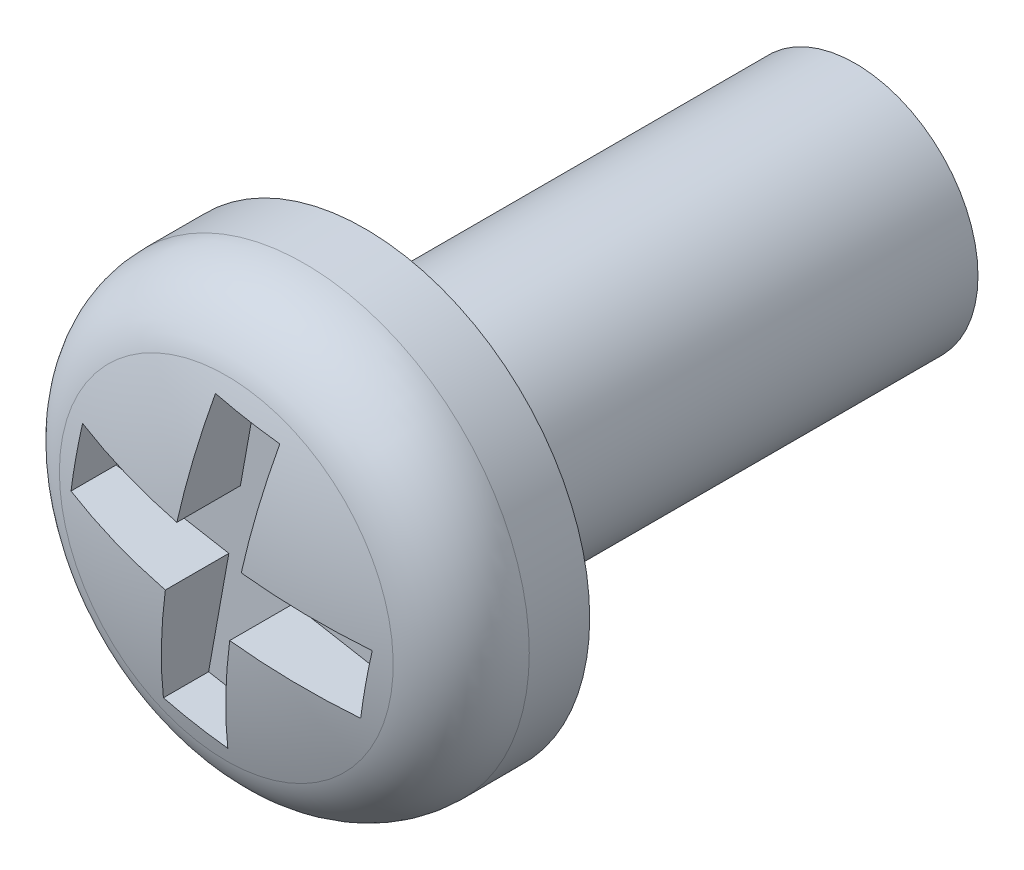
ISO-10303-21;
HEADER;
FILE_DESCRIPTION(('STEP AP214'),'2;1');
FILE_NAME('part.step','',(''),(''),'','','');
FILE_SCHEMA(('AUTOMOTIVE_DESIGN { 1 0 10303 214 1 1 1 1 }'));
ENDSEC;
DATA;
#1=APPLICATION_CONTEXT('core data for automotive mechanical design processes');
#2=APPLICATION_PROTOCOL_DEFINITION('international standard','automotive_design',2000,#1);
#3=PRODUCT_CONTEXT('',#1,'mechanical');
#4=PRODUCT('Part','Part','',(#3));
#5=PRODUCT_RELATED_PRODUCT_CATEGORY('part','',(#4));
#6=PRODUCT_DEFINITION_FORMATION('','',#4);
#7=PRODUCT_DEFINITION_CONTEXT('part definition',#1,'design');
#8=PRODUCT_DEFINITION('design','',#6,#7);
#9=PRODUCT_DEFINITION_SHAPE('','',#8);
#10=(LENGTH_UNIT() NAMED_UNIT(*) SI_UNIT(.MILLI.,.METRE.));
#11=(NAMED_UNIT(*) PLANE_ANGLE_UNIT() SI_UNIT($,.RADIAN.));
#12=(NAMED_UNIT(*) SI_UNIT($,.STERADIAN.) SOLID_ANGLE_UNIT());
#13=UNCERTAINTY_MEASURE_WITH_UNIT(LENGTH_MEASURE(1.E-05),#10,'distance_accuracy_value','');
#14=(GEOMETRIC_REPRESENTATION_CONTEXT(3) GLOBAL_UNCERTAINTY_ASSIGNED_CONTEXT((#13)) GLOBAL_UNIT_ASSIGNED_CONTEXT((#10,
#11,#12)) REPRESENTATION_CONTEXT('',''));
#15=CARTESIAN_POINT('',(0.,0.,0.));
#16=DIRECTION('',(0.,0.,1.));
#17=DIRECTION('',(1.,0.,0.));
#18=AXIS2_PLACEMENT_3D('',#15,#16,#17);
#19=CARTESIAN_POINT('',(-22.2009533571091,31.8118714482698,2.2));
#20=DIRECTION('',(0.,0.,-1.));
#21=DIRECTION('',(-1.,0.,0.));
#22=AXIS2_PLACEMENT_3D('',#19,#20,#21);
#23=PLANE('',#22);
#24=DIRECTION('',(0.984254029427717,-0.176759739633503,0.));
#25=VECTOR('',#24,1.);
#26=CARTESIAN_POINT('',(-20.9644055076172,30.7770045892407,2.2));
#27=LINE('',#26,#25);
#28=CARTESIAN_POINT('',(-22.342361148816,31.0244682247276,2.2));
#29=VERTEX_POINT('',#28);
#30=CARTESIAN_POINT('',(-20.9644055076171,30.7770045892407,2.2));
#31=VERTEX_POINT('',#30);
#32=EDGE_CURVE('E255',#29,#31,#27,.T.);
#33=ORIENTED_EDGE('',*,*,#32,.T.);
#34=DIRECTION('',(-0.176759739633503,-0.984254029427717,0.));
#35=VECTOR('',#34,1.);
#36=CARTESIAN_POINT('',(-21.2118691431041,29.3990489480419,2.2));
#37=LINE('',#36,#35);
#38=CARTESIAN_POINT('',(-21.2118691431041,29.3990489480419,2.2));
#39=VERTEX_POINT('',#38);
#40=EDGE_CURVE('E266',#31,#39,#37,.T.);
#41=ORIENTED_EDGE('',*,*,#40,.T.);
#42=DIRECTION('',(0.984254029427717,-0.176759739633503,0.));
#43=VECTOR('',#42,1.);
#44=CARTESIAN_POINT('',(-20.4244659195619,29.2576411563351,2.2));
#45=LINE('',#44,#43);
#46=CARTESIAN_POINT('',(-20.4244659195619,29.2576411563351,2.2));
#47=VERTEX_POINT('',#46);
#48=EDGE_CURVE('E271',#39,#47,#45,.T.);
#49=ORIENTED_EDGE('',*,*,#48,.T.);
#50=DIRECTION('',(0.176759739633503,0.984254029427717,0.));
#51=VECTOR('',#50,1.);
#52=CARTESIAN_POINT('',(-20.177002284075,30.6355967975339,2.2));
#53=LINE('',#52,#51);
#54=CARTESIAN_POINT('',(-20.177002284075,30.6355967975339,2.2));
#55=VERTEX_POINT('',#54);
#56=EDGE_CURVE('E276',#47,#55,#53,.T.);
#57=ORIENTED_EDGE('',*,*,#56,.T.);
#58=DIRECTION('',(0.984254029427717,-0.176759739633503,0.));
#59=VECTOR('',#58,1.);
#60=CARTESIAN_POINT('',(-18.7990466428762,30.388133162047,2.2));
#61=LINE('',#60,#59);
#62=CARTESIAN_POINT('',(-18.7990466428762,30.388133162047,2.2));
#63=VERTEX_POINT('',#62);
#64=EDGE_CURVE('E281',#55,#63,#61,.T.);
#65=ORIENTED_EDGE('',*,*,#64,.T.);
#66=DIRECTION('',(0.176759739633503,0.984254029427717,0.));
#67=VECTOR('',#66,1.);
#68=CARTESIAN_POINT('',(-18.6576388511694,31.1755363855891,2.2));
#69=LINE('',#68,#67);
#70=CARTESIAN_POINT('',(-18.6576388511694,31.1755363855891,2.2));
#71=VERTEX_POINT('',#70);
#72=EDGE_CURVE('E286',#63,#71,#69,.T.);
#73=ORIENTED_EDGE('',*,*,#72,.T.);
#74=DIRECTION('',(-0.984254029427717,0.176759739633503,0.));
#75=VECTOR('',#74,1.);
#76=CARTESIAN_POINT('',(-20.0355944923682,31.423000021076,2.2));
#77=LINE('',#76,#75);
#78=CARTESIAN_POINT('',(-20.0355944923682,31.423000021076,2.2));
#79=VERTEX_POINT('',#78);
#80=EDGE_CURVE('E291',#71,#79,#77,.T.);
#81=ORIENTED_EDGE('',*,*,#80,.T.);
#82=DIRECTION('',(0.176759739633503,0.984254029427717,0.));
#83=VECTOR('',#82,1.);
#84=CARTESIAN_POINT('',(-19.7881308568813,32.8009556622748,2.2));
#85=LINE('',#84,#83);
#86=CARTESIAN_POINT('',(-19.7881308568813,32.8009556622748,2.2));
#87=VERTEX_POINT('',#86);
#88=EDGE_CURVE('E296',#79,#87,#85,.T.);
#89=ORIENTED_EDGE('',*,*,#88,.T.);
#90=DIRECTION('',(-0.984254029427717,0.176759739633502,0.));
#91=VECTOR('',#90,1.);
#92=CARTESIAN_POINT('',(-20.5755340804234,32.9423634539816,2.2));
#93=LINE('',#92,#91);
#94=CARTESIAN_POINT('',(-20.5755340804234,32.9423634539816,2.2));
#95=VERTEX_POINT('',#94);
#96=EDGE_CURVE('E238',#87,#95,#93,.T.);
#97=ORIENTED_EDGE('',*,*,#96,.T.);
#98=DIRECTION('',(-0.176759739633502,-0.984254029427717,0.));
#99=VECTOR('',#98,1.);
#100=CARTESIAN_POINT('',(-20.8229977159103,31.5644078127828,2.2));
#101=LINE('',#100,#99);
#102=CARTESIAN_POINT('',(-20.8229977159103,31.5644078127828,2.2));
#103=VERTEX_POINT('',#102);
#104=EDGE_CURVE('E240',#95,#103,#101,.T.);
#105=ORIENTED_EDGE('',*,*,#104,.T.);
#106=DIRECTION('',(-0.984254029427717,0.176759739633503,0.));
#107=VECTOR('',#106,1.);
#108=CARTESIAN_POINT('',(-22.2009533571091,31.8118714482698,2.2));
#109=LINE('',#108,#107);
#110=CARTESIAN_POINT('',(-22.2009533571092,31.8118714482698,2.2));
#111=VERTEX_POINT('',#110);
#112=EDGE_CURVE('E241',#103,#111,#109,.T.);
#113=ORIENTED_EDGE('',*,*,#112,.T.);
#114=DIRECTION('',(-0.176759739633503,-0.984254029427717,0.));
#115=VECTOR('',#114,1.);
#116=CARTESIAN_POINT('',(-22.342361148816,31.0244682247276,2.2));
#117=LINE('',#116,#115);
#118=EDGE_CURVE('E209',#111,#29,#117,.T.);
#119=ORIENTED_EDGE('',*,*,#118,.T.);
#120=EDGE_LOOP('',(#33,#41,#49,#57,#65,#73,#81,#89,#97,#105,#113,#119));
#121=FACE_BOUND('',#120,.T.);
#122=ADVANCED_FACE('F17',(#121),#23,.F.);
#123=CARTESIAN_POINT('',(-22.2009533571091,31.8118714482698,2.2));
#124=DIRECTION('',(0.176759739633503,0.984254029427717,0.));
#125=DIRECTION('',(-0.984254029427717,0.176759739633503,0.));
#126=AXIS2_PLACEMENT_3D('',#123,#124,#125);
#127=PLANE('',#126);
#128=ORIENTED_EDGE('',*,*,#112,.F.);
#129=DIRECTION('',(0.,0.,1.));
#130=VECTOR('',#129,1.);
#131=CARTESIAN_POINT('',(-20.8229977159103,31.5644078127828,2.2));
#132=LINE('',#131,#130);
#133=CARTESIAN_POINT('',(-20.8229977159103,31.5644078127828,2.97710541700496));
#134=VERTEX_POINT('',#133);
#135=EDGE_CURVE('E202',#103,#134,#132,.T.);
#136=ORIENTED_EDGE('',*,*,#135,.T.);
#137=CARTESIAN_POINT('',(-22.2009533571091,31.8118714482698,2.75277720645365));
#138=CARTESIAN_POINT('',(-22.1445441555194,31.8017410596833,2.76805420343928));
#139=CARTESIAN_POINT('',(-22.087943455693,31.7915762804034,2.78260124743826));
#140=CARTESIAN_POINT('',(-21.9745055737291,31.7712042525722,2.81020007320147));
#141=CARTESIAN_POINT('',(-21.9176690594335,31.7609971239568,2.82325468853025));
#142=CARTESIAN_POINT('',(-21.8037612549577,31.7405407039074,2.84787651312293));
#143=CARTESIAN_POINT('',(-21.7466903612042,31.7302914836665,2.85944561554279));
#144=CARTESIAN_POINT('',(-21.6323149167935,31.7097510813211,2.88110167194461));
#145=CARTESIAN_POINT('',(-21.5750105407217,31.6994599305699,2.8911895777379));
#146=CARTESIAN_POINT('',(-21.4601684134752,31.6788357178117,2.90988562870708));
#147=CARTESIAN_POINT('',(-21.4026306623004,31.6685026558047,2.91849377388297));
#148=CARTESIAN_POINT('',(-21.2873215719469,31.6477945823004,2.93422986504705));
#149=CARTESIAN_POINT('',(-21.2295501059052,31.6374195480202,2.94135685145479));
#150=CARTESIAN_POINT('',(-21.1137731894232,31.616627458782,2.95412720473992));
#151=CARTESIAN_POINT('',(-21.0557675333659,31.6062103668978,2.95976864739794));
#152=CARTESIAN_POINT('',(-20.9395215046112,31.5853340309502,2.96956186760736));
#153=CARTESIAN_POINT('',(-20.8812808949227,31.5748747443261,2.97371074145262));
#154=CARTESIAN_POINT('',(-20.8229977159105,31.5644078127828,2.97710541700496));
#155=B_SPLINE_CURVE_WITH_KNOTS('',3,(#137,#138,#139,#140,#141,#142,#143,#144,#145,#146,#147,
#148,#149,#150,#151,#152,#153,#154),.UNSPECIFIED.,.F.,.F.,(4,2,2,2,2,2,2,2,4),(0.,
0.177933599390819,0.355523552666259,0.532884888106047,0.710131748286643,0.887378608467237,
1.06473994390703,1.24232989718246,1.42026349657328),.UNSPECIFIED.);
#156=CARTESIAN_POINT('',(-22.2009533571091,31.8118714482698,2.75277720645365));
#157=VERTEX_POINT('',#156);
#158=EDGE_CURVE('E20',#157,#134,#155,.T.);
#159=ORIENTED_EDGE('',*,*,#158,.F.);
#160=DIRECTION('',(0.,0.,1.));
#161=VECTOR('',#160,1.);
#162=CARTESIAN_POINT('',(-22.2009533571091,31.8118714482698,2.2));
#163=LINE('',#162,#161);
#164=EDGE_CURVE('E88',#157,#111,#163,.F.);
#165=ORIENTED_EDGE('',*,*,#164,.T.);
#166=EDGE_LOOP('',(#128,#136,#159,#165));
#167=FACE_BOUND('',#166,.T.);
#168=ADVANCED_FACE('F199',(#167),#127,.F.);
#169=CARTESIAN_POINT('',(-20.8229977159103,31.5644078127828,2.2));
#170=DIRECTION('',(-0.984254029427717,0.176759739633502,0.));
#171=DIRECTION('',(-0.176759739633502,-0.984254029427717,0.));
#172=AXIS2_PLACEMENT_3D('',#169,#170,#171);
#173=PLANE('',#172);
#174=ORIENTED_EDGE('',*,*,#104,.F.);
#175=DIRECTION('',(0.,0.,1.));
#176=VECTOR('',#175,1.);
#177=CARTESIAN_POINT('',(-20.5755340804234,32.9423634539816,2.2));
#178=LINE('',#177,#176);
#179=CARTESIAN_POINT('',(-20.5755340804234,32.9423634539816,2.75277720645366));
#180=VERTEX_POINT('',#179);
#181=EDGE_CURVE('E247',#95,#180,#178,.T.);
#182=ORIENTED_EDGE('',*,*,#181,.T.);
#183=CARTESIAN_POINT('',(-20.8937016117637,31.1707062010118,-4.));
#184=DIRECTION('',(0.984254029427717,-0.176759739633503,0.));
#185=DIRECTION('',(0.176759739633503,0.984254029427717,0.));
#186=AXIS2_PLACEMENT_3D('',#183,#184,#185);
#187=CIRCLE('',#186,6.98856208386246);
#188=EDGE_CURVE('E194',#134,#180,#187,.F.);
#189=ORIENTED_EDGE('',*,*,#188,.F.);
#190=ORIENTED_EDGE('',*,*,#135,.F.);
#191=EDGE_LOOP('',(#174,#182,#189,#190));
#192=FACE_BOUND('',#191,.T.);
#193=ADVANCED_FACE('F187',(#192),#173,.F.);
#194=CARTESIAN_POINT('',(-20.5755340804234,32.9423634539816,2.2));
#195=DIRECTION('',(0.176759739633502,0.984254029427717,0.));
#196=DIRECTION('',(-0.984254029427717,0.176759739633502,0.));
#197=AXIS2_PLACEMENT_3D('',#194,#195,#196);
#198=PLANE('',#197);
#199=ORIENTED_EDGE('',*,*,#96,.F.);
#200=DIRECTION('',(0.,0.,1.));
#201=VECTOR('',#200,1.);
#202=CARTESIAN_POINT('',(-19.7881308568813,32.8009556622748,2.2));
#203=LINE('',#202,#201);
#204=CARTESIAN_POINT('',(-19.7881308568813,32.8009556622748,2.75277720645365));
#205=VERTEX_POINT('',#204);
#206=EDGE_CURVE('E293',#87,#205,#203,.T.);
#207=ORIENTED_EDGE('',*,*,#206,.T.);
#208=CARTESIAN_POINT('',(-20.5755340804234,32.9423634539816,2.75277720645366));
#209=CARTESIAN_POINT('',(-20.4443002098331,32.9187954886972,2.76066827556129));
#210=CARTESIAN_POINT('',(-20.3130663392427,32.8952275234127,2.76461381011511));
#211=CARTESIAN_POINT('',(-20.050598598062,32.8480915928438,2.76461381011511));
#212=CARTESIAN_POINT('',(-19.9193647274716,32.8245236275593,2.76066827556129));
#213=CARTESIAN_POINT('',(-19.7881308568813,32.8009556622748,2.75277720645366));
#214=B_SPLINE_CURVE_WITH_KNOTS('',3,(#208,#209,#210,#211,#212,#213),.UNSPECIFIED.,.F.,.F.,(4,2,
4),(0.,0.400175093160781,0.800350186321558),.UNSPECIFIED.);
#215=EDGE_CURVE('E189',#180,#205,#214,.T.);
#216=ORIENTED_EDGE('',*,*,#215,.F.);
#217=ORIENTED_EDGE('',*,*,#181,.F.);
#218=EDGE_LOOP('',(#199,#207,#216,#217));
#219=FACE_BOUND('',#218,.T.);
#220=ADVANCED_FACE('F182',(#219),#198,.F.);
#221=CARTESIAN_POINT('',(-19.7881308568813,32.8009556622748,2.2));
#222=DIRECTION('',(0.984254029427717,-0.176759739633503,0.));
#223=DIRECTION('',(0.176759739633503,0.984254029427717,0.));
#224=AXIS2_PLACEMENT_3D('',#221,#222,#223);
#225=PLANE('',#224);
#226=ORIENTED_EDGE('',*,*,#88,.F.);
#227=DIRECTION('',(0.,0.,1.));
#228=VECTOR('',#227,1.);
#229=CARTESIAN_POINT('',(-20.0355944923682,31.423000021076,2.2));
#230=LINE('',#229,#228);
#231=CARTESIAN_POINT('',(-20.0355944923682,31.423000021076,2.97710541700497));
#232=VERTEX_POINT('',#231);
#233=EDGE_CURVE('E288',#79,#232,#230,.T.);
#234=ORIENTED_EDGE('',*,*,#233,.T.);
#235=CARTESIAN_POINT('',(-20.1062983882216,31.029298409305,-4.));
#236=DIRECTION('',(0.984254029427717,-0.176759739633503,0.));
#237=DIRECTION('',(0.176759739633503,0.984254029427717,0.));
#238=AXIS2_PLACEMENT_3D('',#235,#236,#237);
#239=CIRCLE('',#238,6.98856208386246);
#240=EDGE_CURVE('E172',#205,#232,#239,.T.);
#241=ORIENTED_EDGE('',*,*,#240,.F.);
#242=ORIENTED_EDGE('',*,*,#206,.F.);
#243=EDGE_LOOP('',(#226,#234,#241,#242));
#244=FACE_BOUND('',#243,.T.);
#245=ADVANCED_FACE('F178',(#244),#225,.F.);
#246=CARTESIAN_POINT('',(-20.0355944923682,31.423000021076,2.2));
#247=DIRECTION('',(0.176759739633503,0.984254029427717,0.));
#248=DIRECTION('',(-0.984254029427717,0.176759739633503,0.));
#249=AXIS2_PLACEMENT_3D('',#246,#247,#248);
#250=PLANE('',#249);
#251=ORIENTED_EDGE('',*,*,#80,.F.);
#252=DIRECTION('',(0.,0.,1.));
#253=VECTOR('',#252,1.);
#254=CARTESIAN_POINT('',(-18.6576388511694,31.1755363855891,2.2));
#255=LINE('',#254,#253);
#256=CARTESIAN_POINT('',(-18.6576388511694,31.1755363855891,2.75277720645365));
#257=VERTEX_POINT('',#256);
#258=EDGE_CURVE('E283',#71,#257,#255,.T.);
#259=ORIENTED_EDGE('',*,*,#258,.T.);
#260=CARTESIAN_POINT('',(-20.0355944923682,31.423000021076,2.97710541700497));
#261=CARTESIAN_POINT('',(-19.977311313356,31.4125330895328,2.97371074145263));
#262=CARTESIAN_POINT('',(-19.9190707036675,31.4020738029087,2.96956186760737));
#263=CARTESIAN_POINT('',(-19.8028246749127,31.3811974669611,2.95976864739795));
#264=CARTESIAN_POINT('',(-19.7448190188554,31.3707803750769,2.95412720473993));
#265=CARTESIAN_POINT('',(-19.6290421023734,31.3499882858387,2.9413568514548));
#266=CARTESIAN_POINT('',(-19.5712706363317,31.3396132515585,2.93422986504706));
#267=CARTESIAN_POINT('',(-19.4559615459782,31.3189051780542,2.91849377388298));
#268=CARTESIAN_POINT('',(-19.3984237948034,31.3085721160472,2.90988562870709));
#269=CARTESIAN_POINT('',(-19.2835816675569,31.2879479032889,2.89118957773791));
#270=CARTESIAN_POINT('',(-19.2262772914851,31.2776567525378,2.88110167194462));
#271=CARTESIAN_POINT('',(-19.1119018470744,31.2571163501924,2.8594456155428));
#272=CARTESIAN_POINT('',(-19.0548309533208,31.2468671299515,2.84787651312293));
#273=CARTESIAN_POINT('',(-18.940923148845,31.2264107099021,2.82325468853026));
#274=CARTESIAN_POINT('',(-18.8840866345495,31.2162035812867,2.81020007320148));
#275=CARTESIAN_POINT('',(-18.7706487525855,31.1958315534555,2.78260124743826));
#276=CARTESIAN_POINT('',(-18.7140480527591,31.1856667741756,2.76805420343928));
#277=CARTESIAN_POINT('',(-18.6576388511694,31.1755363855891,2.75277720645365));
#278=B_SPLINE_CURVE_WITH_KNOTS('',3,(#260,#261,#262,#263,#264,#265,#266,#267,#268,#269,#270,
#271,#272,#273,#274,#275,#276,#277),.UNSPECIFIED.,.F.,.F.,(4,2,2,2,2,2,2,2,4),(0.,
0.177933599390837,0.355523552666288,0.532884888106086,0.710131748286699,0.887378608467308,
1.06473994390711,1.24232989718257,1.4202634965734),.UNSPECIFIED.);
#279=EDGE_CURVE('E165',#232,#257,#278,.T.);
#280=ORIENTED_EDGE('',*,*,#279,.F.);
#281=ORIENTED_EDGE('',*,*,#233,.F.);
#282=EDGE_LOOP('',(#251,#259,#280,#281));
#283=FACE_BOUND('',#282,.T.);
#284=ADVANCED_FACE('F174',(#283),#250,.F.);
#285=CARTESIAN_POINT('',(-18.6576388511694,31.1755363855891,2.2));
#286=DIRECTION('',(0.984254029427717,-0.176759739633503,0.));
#287=DIRECTION('',(0.176759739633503,0.984254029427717,0.));
#288=AXIS2_PLACEMENT_3D('',#285,#286,#287);
#289=PLANE('',#288);
#290=ORIENTED_EDGE('',*,*,#72,.F.);
#291=DIRECTION('',(0.,0.,1.));
#292=VECTOR('',#291,1.);
#293=CARTESIAN_POINT('',(-18.7990466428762,30.388133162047,2.2));
#294=LINE('',#293,#292);
#295=CARTESIAN_POINT('',(-18.7990466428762,30.388133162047,2.75277720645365));
#296=VERTEX_POINT('',#295);
#297=EDGE_CURVE('E278',#63,#296,#294,.T.);
#298=ORIENTED_EDGE('',*,*,#297,.T.);
#299=CARTESIAN_POINT('',(-18.7283427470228,30.7818347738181,2.7646138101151));
#300=CARTESIAN_POINT('',(-18.7637256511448,30.5848115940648,2.7646138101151));
#301=CARTESIAN_POINT('',(-18.7990466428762,30.388133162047,2.75277720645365));
#302=B_SPLINE_CURVE_WITH_KNOTS('',2,(#299,#300,#301),.UNSPECIFIED.,.F.,.F.,(3,3),(0.,1.),.UNSPECIFIED.);
#303=CARTESIAN_POINT('',(-18.7283427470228,30.7818347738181,2.7646138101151));
#304=VERTEX_POINT('',#303);
#305=EDGE_CURVE('E164',#304,#296,#302,.T.);
#306=ORIENTED_EDGE('',*,*,#305,.F.);
#307=CARTESIAN_POINT('',(-18.6576388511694,31.1755363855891,2.75277720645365));
#308=CARTESIAN_POINT('',(-18.6929598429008,30.9788579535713,2.7646138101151));
#309=CARTESIAN_POINT('',(-18.7283427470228,30.7818347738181,2.7646138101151));
#310=B_SPLINE_CURVE_WITH_KNOTS('',2,(#307,#308,#309),.UNSPECIFIED.,.F.,.F.,(3,3),(0.,1.),.UNSPECIFIED.);
#311=EDGE_CURVE('E171',#257,#304,#310,.T.);
#312=ORIENTED_EDGE('',*,*,#311,.F.);
#313=ORIENTED_EDGE('',*,*,#258,.F.);
#314=EDGE_LOOP('',(#290,#298,#306,#312,#313));
#315=FACE_BOUND('',#314,.T.);
#316=ADVANCED_FACE('F154',(#315),#289,.F.);
#317=CARTESIAN_POINT('',(-18.7990466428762,30.388133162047,2.2));
#318=DIRECTION('',(-0.176759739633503,-0.984254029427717,0.));
#319=DIRECTION('',(0.984254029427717,-0.176759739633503,0.));
#320=AXIS2_PLACEMENT_3D('',#317,#318,#319);
#321=PLANE('',#320);
#322=ORIENTED_EDGE('',*,*,#64,.F.);
#323=DIRECTION('',(0.,0.,1.));
#324=VECTOR('',#323,1.);
#325=CARTESIAN_POINT('',(-20.177002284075,30.6355967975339,2.2));
#326=LINE('',#325,#324);
#327=CARTESIAN_POINT('',(-20.177002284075,30.6355967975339,2.97710541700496));
#328=VERTEX_POINT('',#327);
#329=EDGE_CURVE('E273',#55,#328,#326,.T.);
#330=ORIENTED_EDGE('',*,*,#329,.T.);
#331=CARTESIAN_POINT('',(-18.7990466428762,30.388133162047,2.75277720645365));
#332=CARTESIAN_POINT('',(-18.8554558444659,30.3982635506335,2.76805420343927));
#333=CARTESIAN_POINT('',(-18.9120565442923,30.4084283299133,2.78260124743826));
#334=CARTESIAN_POINT('',(-19.0254944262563,30.4288003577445,2.81020007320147));
#335=CARTESIAN_POINT('',(-19.0823309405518,30.4390074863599,2.82325468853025));
#336=CARTESIAN_POINT('',(-19.1962387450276,30.4594639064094,2.84787651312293));
#337=CARTESIAN_POINT('',(-19.2533096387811,30.4697131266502,2.85944561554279));
#338=CARTESIAN_POINT('',(-19.3676850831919,30.4902535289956,2.88110167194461));
#339=CARTESIAN_POINT('',(-19.4249894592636,30.5005446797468,2.8911895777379));
#340=CARTESIAN_POINT('',(-19.5398315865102,30.521168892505,2.90988562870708));
#341=CARTESIAN_POINT('',(-19.5973693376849,30.531501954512,2.91849377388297));
#342=CARTESIAN_POINT('',(-19.7126784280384,30.5522100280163,2.93422986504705));
#343=CARTESIAN_POINT('',(-19.7704498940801,30.5625850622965,2.94135685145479));
#344=CARTESIAN_POINT('',(-19.8862268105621,30.5833771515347,2.95412720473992));
#345=CARTESIAN_POINT('',(-19.9442324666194,30.5937942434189,2.95976864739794));
#346=CARTESIAN_POINT('',(-20.0604784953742,30.6146705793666,2.96956186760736));
#347=CARTESIAN_POINT('',(-20.1187191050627,30.6251298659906,2.97371074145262));
#348=CARTESIAN_POINT('',(-20.1770022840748,30.6355967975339,2.97710541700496));
#349=B_SPLINE_CURVE_WITH_KNOTS('',3,(#331,#332,#333,#334,#335,#336,#337,#338,#339,#340,#341,
#342,#343,#344,#345,#346,#347,#348),.UNSPECIFIED.,.F.,.F.,(4,2,2,2,2,2,2,2,4),(0.,
0.177933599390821,0.355523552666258,0.532884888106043,0.710131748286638,0.887378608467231,
1.06473994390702,1.24232989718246,1.42026349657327),.UNSPECIFIED.);
#350=EDGE_CURVE('E158',#296,#328,#349,.T.);
#351=ORIENTED_EDGE('',*,*,#350,.F.);
#352=ORIENTED_EDGE('',*,*,#297,.F.);
#353=EDGE_LOOP('',(#322,#330,#351,#352));
#354=FACE_BOUND('',#353,.T.);
#355=ADVANCED_FACE('F149',(#354),#321,.F.);
#356=CARTESIAN_POINT('',(-20.177002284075,30.6355967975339,2.2));
#357=DIRECTION('',(0.984254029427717,-0.176759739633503,0.));
#358=DIRECTION('',(0.176759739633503,0.984254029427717,0.));
#359=AXIS2_PLACEMENT_3D('',#356,#357,#358);
#360=PLANE('',#359);
#361=ORIENTED_EDGE('',*,*,#56,.F.);
#362=DIRECTION('',(0.,0.,1.));
#363=VECTOR('',#362,1.);
#364=CARTESIAN_POINT('',(-20.4244659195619,29.2576411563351,2.2));
#365=LINE('',#364,#363);
#366=CARTESIAN_POINT('',(-20.4244659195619,29.2576411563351,2.75277720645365));
#367=VERTEX_POINT('',#366);
#368=EDGE_CURVE('E268',#47,#367,#365,.T.);
#369=ORIENTED_EDGE('',*,*,#368,.T.);
#370=CARTESIAN_POINT('',(-20.1062983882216,31.029298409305,-4.));
#371=DIRECTION('',(0.984254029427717,-0.176759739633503,0.));
#372=DIRECTION('',(0.176759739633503,0.984254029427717,0.));
#373=AXIS2_PLACEMENT_3D('',#370,#371,#372);
#374=CIRCLE('',#373,6.98856208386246);
#375=EDGE_CURVE('E139',#328,#367,#374,.T.);
#376=ORIENTED_EDGE('',*,*,#375,.F.);
#377=ORIENTED_EDGE('',*,*,#329,.F.);
#378=EDGE_LOOP('',(#361,#369,#376,#377));
#379=FACE_BOUND('',#378,.T.);
#380=ADVANCED_FACE('F145',(#379),#360,.F.);
#381=CARTESIAN_POINT('',(-20.4244659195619,29.2576411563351,2.2));
#382=DIRECTION('',(-0.176759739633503,-0.984254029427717,0.));
#383=DIRECTION('',(0.984254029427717,-0.176759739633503,0.));
#384=AXIS2_PLACEMENT_3D('',#381,#382,#383);
#385=PLANE('',#384);
#386=ORIENTED_EDGE('',*,*,#48,.F.);
#387=DIRECTION('',(0.,0.,1.));
#388=VECTOR('',#387,1.);
#389=CARTESIAN_POINT('',(-21.2118691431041,29.3990489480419,2.2));
#390=LINE('',#389,#388);
#391=CARTESIAN_POINT('',(-21.211869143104,29.3990489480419,2.75277720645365));
#392=VERTEX_POINT('',#391);
#393=EDGE_CURVE('E258',#39,#392,#390,.T.);
#394=ORIENTED_EDGE('',*,*,#393,.T.);
#395=CARTESIAN_POINT('',(-20.4244659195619,29.2576411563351,2.75277720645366));
#396=CARTESIAN_POINT('',(-20.5556997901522,29.2812091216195,2.76066827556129));
#397=CARTESIAN_POINT('',(-20.6869336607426,29.304777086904,2.76461381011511));
#398=CARTESIAN_POINT('',(-20.9494014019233,29.3519130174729,2.76461381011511));
#399=CARTESIAN_POINT('',(-21.0806352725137,29.3754809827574,2.76066827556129));
#400=CARTESIAN_POINT('',(-21.2118691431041,29.3990489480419,2.75277720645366));
#401=B_SPLINE_CURVE_WITH_KNOTS('',3,(#395,#396,#397,#398,#399,#400),.UNSPECIFIED.,.F.,.F.,(4,2,
4),(0.,0.400175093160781,0.800350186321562),.UNSPECIFIED.);
#402=EDGE_CURVE('E133',#367,#392,#401,.T.);
#403=ORIENTED_EDGE('',*,*,#402,.F.);
#404=ORIENTED_EDGE('',*,*,#368,.F.);
#405=EDGE_LOOP('',(#386,#394,#403,#404));
#406=FACE_BOUND('',#405,.T.);
#407=ADVANCED_FACE('F141',(#406),#385,.F.);
#408=CARTESIAN_POINT('',(-21.2118691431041,29.3990489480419,2.2));
#409=DIRECTION('',(-0.984254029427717,0.176759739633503,0.));
#410=DIRECTION('',(-0.176759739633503,-0.984254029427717,0.));
#411=AXIS2_PLACEMENT_3D('',#408,#409,#410);
#412=PLANE('',#411);
#413=ORIENTED_EDGE('',*,*,#40,.F.);
#414=DIRECTION('',(0.,0.,1.));
#415=VECTOR('',#414,1.);
#416=CARTESIAN_POINT('',(-20.9644055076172,30.7770045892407,2.2));
#417=LINE('',#416,#415);
#418=CARTESIAN_POINT('',(-20.9644055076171,30.7770045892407,2.97710541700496));
#419=VERTEX_POINT('',#418);
#420=EDGE_CURVE('E257',#31,#419,#417,.T.);
#421=ORIENTED_EDGE('',*,*,#420,.T.);
#422=CARTESIAN_POINT('',(-20.8937016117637,31.1707062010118,-4.));
#423=DIRECTION('',(0.984254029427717,-0.176759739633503,0.));
#424=DIRECTION('',(0.176759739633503,0.984254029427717,0.));
#425=AXIS2_PLACEMENT_3D('',#422,#423,#424);
#426=CIRCLE('',#425,6.98856208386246);
#427=EDGE_CURVE('E101',#392,#419,#426,.F.);
#428=ORIENTED_EDGE('',*,*,#427,.F.);
#429=ORIENTED_EDGE('',*,*,#393,.F.);
#430=EDGE_LOOP('',(#413,#421,#428,#429));
#431=FACE_BOUND('',#430,.T.);
#432=ADVANCED_FACE('F125',(#431),#412,.F.);
#433=CARTESIAN_POINT('',(-20.9644055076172,30.7770045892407,2.2));
#434=DIRECTION('',(-0.176759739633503,-0.984254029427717,0.));
#435=DIRECTION('',(0.984254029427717,-0.176759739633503,0.));
#436=AXIS2_PLACEMENT_3D('',#433,#434,#435);
#437=PLANE('',#436);
#438=ORIENTED_EDGE('',*,*,#32,.F.);
#439=DIRECTION('',(0.,0.,1.));
#440=VECTOR('',#439,1.);
#441=CARTESIAN_POINT('',(-22.342361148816,31.0244682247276,2.2));
#442=LINE('',#441,#440);
#443=CARTESIAN_POINT('',(-22.342361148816,31.0244682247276,2.75277720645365));
#444=VERTEX_POINT('',#443);
#445=EDGE_CURVE('E39',#29,#444,#442,.T.);
#446=ORIENTED_EDGE('',*,*,#445,.T.);
#447=CARTESIAN_POINT('',(-20.9644055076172,30.7770045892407,2.97710541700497));
#448=CARTESIAN_POINT('',(-21.0226886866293,30.7874715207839,2.97371074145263));
#449=CARTESIAN_POINT('',(-21.0809292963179,30.797930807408,2.96956186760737));
#450=CARTESIAN_POINT('',(-21.1971753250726,30.8188071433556,2.95976864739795));
#451=CARTESIAN_POINT('',(-21.2551809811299,30.8292242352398,2.95412720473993));
#452=CARTESIAN_POINT('',(-21.370957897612,30.850016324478,2.9413568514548));
#453=CARTESIAN_POINT('',(-21.4287293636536,30.8603913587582,2.93422986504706));
#454=CARTESIAN_POINT('',(-21.5440384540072,30.8810994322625,2.91849377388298));
#455=CARTESIAN_POINT('',(-21.6015762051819,30.8914324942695,2.90988562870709));
#456=CARTESIAN_POINT('',(-21.7164183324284,30.9120567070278,2.89118957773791));
#457=CARTESIAN_POINT('',(-21.7737227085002,30.922347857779,2.88110167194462));
#458=CARTESIAN_POINT('',(-21.888098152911,30.9428882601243,2.8594456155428));
#459=CARTESIAN_POINT('',(-21.9451690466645,30.9531374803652,2.84787651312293));
#460=CARTESIAN_POINT('',(-22.0590768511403,30.9735939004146,2.82325468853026));
#461=CARTESIAN_POINT('',(-22.1159133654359,30.98380102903,2.81020007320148));
#462=CARTESIAN_POINT('',(-22.2293512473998,31.0041730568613,2.78260124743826));
#463=CARTESIAN_POINT('',(-22.2859519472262,31.0143378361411,2.76805420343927));
#464=CARTESIAN_POINT('',(-22.342361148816,31.0244682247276,2.75277720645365));
#465=B_SPLINE_CURVE_WITH_KNOTS('',3,(#447,#448,#449,#450,#451,#452,#453,#454,#455,#456,#457,
#458,#459,#460,#461,#462,#463,#464),.UNSPECIFIED.,.F.,.F.,(4,2,2,2,2,2,2,2,4),(0.,
0.177933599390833,0.355523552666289,0.532884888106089,0.710131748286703,0.887378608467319,
1.06473994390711,1.24232989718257,1.4202634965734),.UNSPECIFIED.);
#466=EDGE_CURVE('E95',#419,#444,#465,.T.);
#467=ORIENTED_EDGE('',*,*,#466,.F.);
#468=ORIENTED_EDGE('',*,*,#420,.F.);
#469=EDGE_LOOP('',(#438,#446,#467,#468));
#470=FACE_BOUND('',#469,.T.);
#471=ADVANCED_FACE('F118',(#470),#437,.F.);
#472=CARTESIAN_POINT('',(-22.342361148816,31.0244682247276,2.2));
#473=DIRECTION('',(-0.984254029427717,0.176759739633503,0.));
#474=DIRECTION('',(-0.176759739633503,-0.984254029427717,0.));
#475=AXIS2_PLACEMENT_3D('',#472,#473,#474);
#476=PLANE('',#475);
#477=ORIENTED_EDGE('',*,*,#118,.F.);
#478=ORIENTED_EDGE('',*,*,#164,.F.);
#479=CARTESIAN_POINT('',(-22.2716572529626,31.4181698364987,2.7646138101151));
#480=CARTESIAN_POINT('',(-22.2362743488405,31.6151930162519,2.7646138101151));
#481=CARTESIAN_POINT('',(-22.2009533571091,31.8118714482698,2.75277720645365));
#482=B_SPLINE_CURVE_WITH_KNOTS('',2,(#479,#480,#481),.UNSPECIFIED.,.F.,.F.,(3,3),(0.,1.),.UNSPECIFIED.);
#483=CARTESIAN_POINT('',(-22.2716572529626,31.4181698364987,2.7646138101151));
#484=VERTEX_POINT('',#483);
#485=EDGE_CURVE('E81',#484,#157,#482,.T.);
#486=ORIENTED_EDGE('',*,*,#485,.F.);
#487=CARTESIAN_POINT('',(-22.342361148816,31.0244682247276,2.75277720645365));
#488=CARTESIAN_POINT('',(-22.3070401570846,31.2211466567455,2.7646138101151));
#489=CARTESIAN_POINT('',(-22.2716572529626,31.4181698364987,2.7646138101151));
#490=B_SPLINE_CURVE_WITH_KNOTS('',2,(#487,#488,#489),.UNSPECIFIED.,.F.,.F.,(3,3),(0.,1.),.UNSPECIFIED.);
#491=EDGE_CURVE('E85',#444,#484,#490,.T.);
#492=ORIENTED_EDGE('',*,*,#491,.F.);
#493=ORIENTED_EDGE('',*,*,#445,.F.);
#494=EDGE_LOOP('',(#477,#478,#486,#492,#493));
#495=FACE_BOUND('',#494,.T.);
#496=ADVANCED_FACE('F84',(#495),#476,.F.);
#497=CARTESIAN_POINT('',(-20.4999999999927,31.1000023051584,-4.));
#498=DIRECTION('',(0.984254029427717,-0.176759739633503,0.));
#499=DIRECTION('',(0.,0.,-1.));
#500=AXIS2_PLACEMENT_3D('',#497,#498,#499);
#501=SPHERICAL_SURFACE('',#500,7.);
#502=CARTESIAN_POINT('',(-20.4999999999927,31.1000023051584,2.69564016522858));
#503=DIRECTION('',(0.,0.,1.));
#504=DIRECTION('',(-0.176759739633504,-0.984254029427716,0.));
#505=AXIS2_PLACEMENT_3D('',#502,#503,#504);
#506=CIRCLE('',#505,2.04166666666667);
#507=CARTESIAN_POINT('',(-20.8608844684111,29.0904836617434,2.69564016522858));
#508=VERTEX_POINT('',#507);
#509=EDGE_CURVE('E96',#508,#508,#506,.F.);
#510=ORIENTED_EDGE('',*,*,#509,.F.);
#511=EDGE_LOOP('',(#510));
#512=FACE_BOUND('',#511,.T.);
#513=ORIENTED_EDGE('',*,*,#466,.T.);
#514=ORIENTED_EDGE('',*,*,#491,.T.);
#515=ORIENTED_EDGE('',*,*,#485,.T.);
#516=ORIENTED_EDGE('',*,*,#158,.T.);
#517=ORIENTED_EDGE('',*,*,#188,.T.);
#518=ORIENTED_EDGE('',*,*,#215,.T.);
#519=ORIENTED_EDGE('',*,*,#240,.T.);
#520=ORIENTED_EDGE('',*,*,#279,.T.);
#521=ORIENTED_EDGE('',*,*,#311,.T.);
#522=ORIENTED_EDGE('',*,*,#305,.T.);
#523=ORIENTED_EDGE('',*,*,#350,.T.);
#524=ORIENTED_EDGE('',*,*,#375,.T.);
#525=ORIENTED_EDGE('',*,*,#402,.T.);
#526=ORIENTED_EDGE('',*,*,#427,.T.);
#527=EDGE_LOOP('',(#513,#514,#515,#516,#517,#518,#519,#520,#521,#522,#523,#524,#525,#526));
#528=FACE_BOUND('',#527,.T.);
#529=ADVANCED_FACE('F93',(#512,#528),#501,.T.);
#530=CARTESIAN_POINT('',(-20.4999999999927,31.1000023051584,1.7391201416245));
#531=DIRECTION('',(0.,0.,1.));
#532=DIRECTION('',(-0.176759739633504,-0.984254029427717,0.));
#533=AXIS2_PLACEMENT_3D('',#530,#531,#532);
#534=TOROIDAL_SURFACE('',#533,1.75,1.);
#535=ORIENTED_EDGE('',*,*,#509,.T.);
#536=EDGE_LOOP('',(#535));
#537=FACE_BOUND('',#536,.T.);
#538=CARTESIAN_POINT('',(-20.4999999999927,31.1000023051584,1.7391201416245));
#539=DIRECTION('',(0.,0.,1.));
#540=DIRECTION('',(1.,0.,0.));
#541=AXIS2_PLACEMENT_3D('',#538,#539,#540);
#542=CIRCLE('',#541,2.75);
#543=CARTESIAN_POINT('',(-17.7499999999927,31.1000023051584,1.7391201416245));
#544=VERTEX_POINT('',#543);
#545=EDGE_CURVE('E99',#544,#544,#542,.F.);
#546=ORIENTED_EDGE('',*,*,#545,.F.);
#547=EDGE_LOOP('',(#546));
#548=FACE_BOUND('',#547,.T.);
#549=ADVANCED_FACE('F314',(#537,#548),#534,.T.);
#550=CARTESIAN_POINT('',(-20.4999999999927,31.1000023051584,3.));
#551=DIRECTION('',(0.,0.,1.));
#552=DIRECTION('',(1.,0.,0.));
#553=AXIS2_PLACEMENT_3D('',#550,#551,#552);
#554=CYLINDRICAL_SURFACE('',#553,2.75);
#555=ORIENTED_EDGE('',*,*,#545,.T.);
#556=EDGE_LOOP('',(#555));
#557=FACE_BOUND('',#556,.T.);
#558=CARTESIAN_POINT('',(-20.4999999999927,31.1000023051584,1.));
#559=DIRECTION('',(0.,0.,1.));
#560=DIRECTION('',(1.,0.,0.));
#561=AXIS2_PLACEMENT_3D('',#558,#559,#560);
#562=CIRCLE('',#561,2.75);
#563=CARTESIAN_POINT('',(-17.7499999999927,31.1000023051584,1.));
#564=VERTEX_POINT('',#563);
#565=EDGE_CURVE('E305',#564,#564,#562,.T.);
#566=ORIENTED_EDGE('',*,*,#565,.T.);
#567=EDGE_LOOP('',(#566));
#568=FACE_BOUND('',#567,.T.);
#569=ADVANCED_FACE('F317',(#557,#568),#554,.T.);
#570=CARTESIAN_POINT('',(-19.0236189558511,30.8348626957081,-5.));
#571=DIRECTION('',(0.,0.,1.));
#572=DIRECTION('',(1.,0.,0.));
#573=AXIS2_PLACEMENT_3D('',#570,#571,#572);
#574=PLANE('',#573);
#575=CARTESIAN_POINT('',(-20.4999999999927,31.1000023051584,-5.));
#576=DIRECTION('',(0.,0.,1.));
#577=DIRECTION('',(1.,0.,0.));
#578=AXIS2_PLACEMENT_3D('',#575,#576,#577);
#579=CIRCLE('',#578,1.5);
#580=CARTESIAN_POINT('',(-18.9999999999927,31.1000023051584,-5.));
#581=VERTEX_POINT('',#580);
#582=EDGE_CURVE('E30',#581,#581,#579,.T.);
#583=ORIENTED_EDGE('',*,*,#582,.F.);
#584=EDGE_LOOP('',(#583));
#585=FACE_BOUND('',#584,.T.);
#586=ADVANCED_FACE('F321',(#585),#574,.F.);
#587=CARTESIAN_POINT('',(-19.0236189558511,30.8348626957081,1.));
#588=DIRECTION('',(0.,0.,1.));
#589=DIRECTION('',(1.,0.,0.));
#590=AXIS2_PLACEMENT_3D('',#587,#588,#589);
#591=PLANE('',#590);
#592=CARTESIAN_POINT('',(-20.4999999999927,31.1000023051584,1.));
#593=DIRECTION('',(0.,0.,1.));
#594=DIRECTION('',(1.,0.,0.));
#595=AXIS2_PLACEMENT_3D('',#592,#593,#594);
#596=CIRCLE('',#595,1.5);
#597=CARTESIAN_POINT('',(-18.9999999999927,31.1000023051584,1.));
#598=VERTEX_POINT('',#597);
#599=EDGE_CURVE('E11',#598,#598,#596,.F.);
#600=ORIENTED_EDGE('',*,*,#599,.F.);
#601=EDGE_LOOP('',(#600));
#602=FACE_BOUND('',#601,.T.);
#603=ORIENTED_EDGE('',*,*,#565,.F.);
#604=EDGE_LOOP('',(#603));
#605=FACE_BOUND('',#604,.T.);
#606=ADVANCED_FACE('F324',(#602,#605),#591,.F.);
#607=CARTESIAN_POINT('',(-20.4999999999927,31.1000023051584,3.));
#608=DIRECTION('',(0.,0.,1.));
#609=DIRECTION('',(1.,0.,0.));
#610=AXIS2_PLACEMENT_3D('',#607,#608,#609);
#611=CYLINDRICAL_SURFACE('',#610,1.5);
#612=ORIENTED_EDGE('',*,*,#599,.T.);
#613=EDGE_LOOP('',(#612));
#614=FACE_BOUND('',#613,.T.);
#615=ORIENTED_EDGE('',*,*,#582,.T.);
#616=EDGE_LOOP('',(#615));
#617=FACE_BOUND('',#616,.T.);
#618=ADVANCED_FACE('F328',(#614,#617),#611,.T.);
#619=CLOSED_SHELL('',(#122,#168,#193,#220,#245,#284,#316,#355,#380,#407,#432,#471,#496,#529,
#549,#569,#586,#606,#618));
#620=MANIFOLD_SOLID_BREP('B1',#619);
#621=ADVANCED_BREP_SHAPE_REPRESENTATION('',(#18,#620),#14);
#622=SHAPE_DEFINITION_REPRESENTATION(#9,#621);
ENDSEC;
END-ISO-10303-21;
